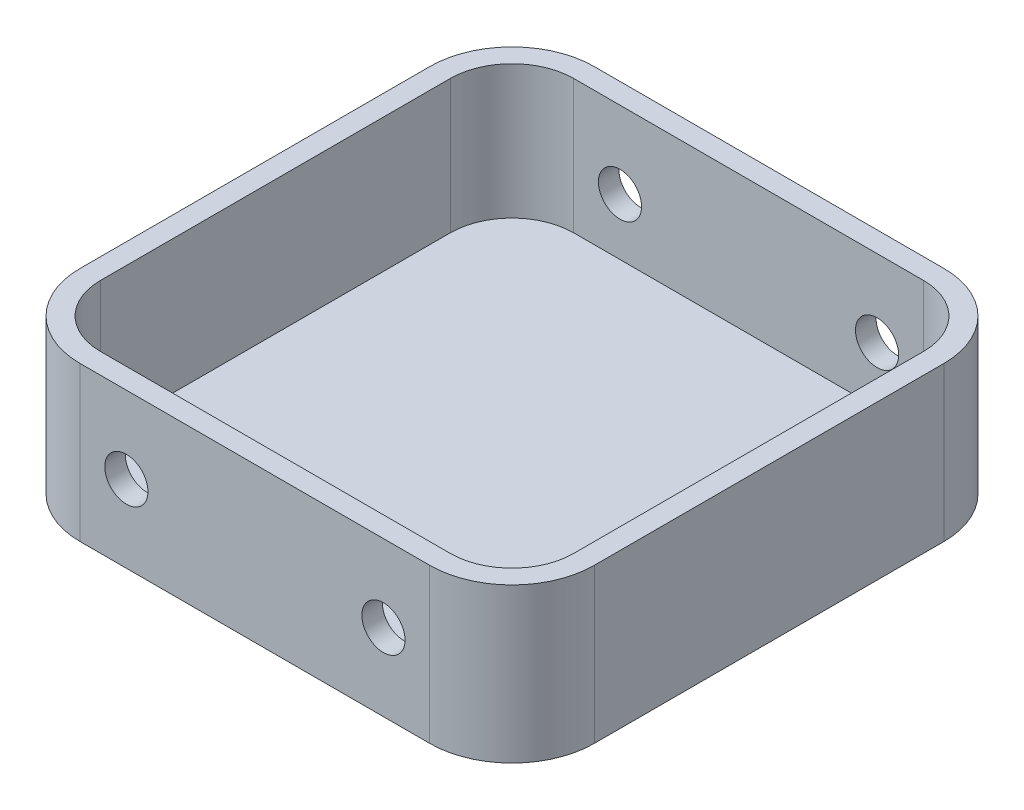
ISO-10303-21;
HEADER;
FILE_DESCRIPTION(('STEP AP214'),'2;1');
FILE_NAME('part.step','',(''),(''),'','','');
FILE_SCHEMA(('AUTOMOTIVE_DESIGN { 1 0 10303 214 1 1 1 1 }'));
ENDSEC;
DATA;
#1=APPLICATION_CONTEXT('core data for automotive mechanical design processes');
#2=APPLICATION_PROTOCOL_DEFINITION('international standard','automotive_design',2000,#1);
#3=PRODUCT_CONTEXT('',#1,'mechanical');
#4=PRODUCT('Part','Part','',(#3));
#5=PRODUCT_RELATED_PRODUCT_CATEGORY('part','',(#4));
#6=PRODUCT_DEFINITION_FORMATION('','',#4);
#7=PRODUCT_DEFINITION_CONTEXT('part definition',#1,'design');
#8=PRODUCT_DEFINITION('design','',#6,#7);
#9=PRODUCT_DEFINITION_SHAPE('','',#8);
#10=(LENGTH_UNIT() NAMED_UNIT(*) SI_UNIT(.MILLI.,.METRE.));
#11=(NAMED_UNIT(*) PLANE_ANGLE_UNIT() SI_UNIT($,.RADIAN.));
#12=(NAMED_UNIT(*) SI_UNIT($,.STERADIAN.) SOLID_ANGLE_UNIT());
#13=UNCERTAINTY_MEASURE_WITH_UNIT(LENGTH_MEASURE(1.E-05),#10,'distance_accuracy_value','');
#14=(GEOMETRIC_REPRESENTATION_CONTEXT(3) GLOBAL_UNCERTAINTY_ASSIGNED_CONTEXT((#13)) GLOBAL_UNIT_ASSIGNED_CONTEXT((#10,
#11,#12)) REPRESENTATION_CONTEXT('',''));
#15=CARTESIAN_POINT('',(0.,0.,0.));
#16=DIRECTION('',(0.,0.,1.));
#17=DIRECTION('',(1.,0.,0.));
#18=AXIS2_PLACEMENT_3D('',#15,#16,#17);
#19=CARTESIAN_POINT('',(25.,15.,-25.));
#20=DIRECTION('',(-1.,0.,0.));
#21=DIRECTION('',(0.,0.,1.));
#22=AXIS2_PLACEMENT_3D('',#19,#20,#21);
#23=PLANE('',#22);
#24=DIRECTION('',(0.,0.,-1.));
#25=VECTOR('',#24,1.);
#26=CARTESIAN_POINT('',(25.,15.,-25.));
#27=LINE('',#26,#25);
#28=CARTESIAN_POINT('',(25.,15.,17.));
#29=VERTEX_POINT('',#28);
#30=CARTESIAN_POINT('',(25.,15.,-17.));
#31=VERTEX_POINT('',#30);
#32=EDGE_CURVE('E215',#29,#31,#27,.T.);
#33=ORIENTED_EDGE('',*,*,#32,.F.);
#34=DIRECTION('',(0.,-1.,0.));
#35=VECTOR('',#34,1.);
#36=CARTESIAN_POINT('',(25.,15.,17.));
#37=LINE('',#36,#35);
#38=CARTESIAN_POINT('',(25.,0.,17.));
#39=VERTEX_POINT('',#38);
#40=EDGE_CURVE('E240',#29,#39,#37,.T.);
#41=ORIENTED_EDGE('',*,*,#40,.T.);
#42=DIRECTION('',(0.,0.,-1.));
#43=VECTOR('',#42,1.);
#44=CARTESIAN_POINT('',(25.,0.,-25.));
#45=LINE('',#44,#43);
#46=CARTESIAN_POINT('',(25.,0.,-17.));
#47=VERTEX_POINT('',#46);
#48=EDGE_CURVE('E228',#39,#47,#45,.T.);
#49=ORIENTED_EDGE('',*,*,#48,.T.);
#50=DIRECTION('',(0.,-1.,0.));
#51=VECTOR('',#50,1.);
#52=CARTESIAN_POINT('',(25.,15.,-17.));
#53=LINE('',#52,#51);
#54=EDGE_CURVE('E227',#47,#31,#53,.F.);
#55=ORIENTED_EDGE('',*,*,#54,.T.);
#56=EDGE_LOOP('',(#33,#41,#49,#55));
#57=FACE_BOUND('',#56,.T.);
#58=ADVANCED_FACE('F48',(#57),#23,.F.);
#59=CARTESIAN_POINT('',(-25.,15.,-25.));
#60=DIRECTION('',(0.,0.,1.));
#61=DIRECTION('',(1.,0.,0.));
#62=AXIS2_PLACEMENT_3D('',#59,#60,#61);
#63=PLANE('',#62);
#64=CARTESIAN_POINT('',(12.5,7.5,-25.));
#65=DIRECTION('',(0.,0.,-1.));
#66=DIRECTION('',(-1.,0.,0.));
#67=AXIS2_PLACEMENT_3D('',#64,#65,#66);
#68=CIRCLE('',#67,2.1);
#69=CARTESIAN_POINT('',(10.4,7.5,-25.));
#70=VERTEX_POINT('',#69);
#71=EDGE_CURVE('E560',#70,#70,#68,.T.);
#72=ORIENTED_EDGE('',*,*,#71,.F.);
#73=EDGE_LOOP('',(#72));
#74=FACE_BOUND('',#73,.T.);
#75=CARTESIAN_POINT('',(-12.5,7.5,-25.));
#76=DIRECTION('',(0.,0.,-1.));
#77=DIRECTION('',(-1.,0.,0.));
#78=AXIS2_PLACEMENT_3D('',#75,#76,#77);
#79=CIRCLE('',#78,2.1);
#80=CARTESIAN_POINT('',(-14.6,7.5,-25.));
#81=VERTEX_POINT('',#80);
#82=EDGE_CURVE('E278',#81,#81,#79,.T.);
#83=ORIENTED_EDGE('',*,*,#82,.F.);
#84=EDGE_LOOP('',(#83));
#85=FACE_BOUND('',#84,.T.);
#86=DIRECTION('',(-1.,0.,0.));
#87=VECTOR('',#86,1.);
#88=CARTESIAN_POINT('',(-25.,15.,-25.));
#89=LINE('',#88,#87);
#90=CARTESIAN_POINT('',(17.,15.,-25.));
#91=VERTEX_POINT('',#90);
#92=CARTESIAN_POINT('',(-17.,15.,-25.));
#93=VERTEX_POINT('',#92);
#94=EDGE_CURVE('E218',#91,#93,#89,.T.);
#95=ORIENTED_EDGE('',*,*,#94,.F.);
#96=DIRECTION('',(0.,-1.,0.));
#97=VECTOR('',#96,1.);
#98=CARTESIAN_POINT('',(17.,15.,-25.));
#99=LINE('',#98,#97);
#100=CARTESIAN_POINT('',(17.,0.,-25.));
#101=VERTEX_POINT('',#100);
#102=EDGE_CURVE('E13',#91,#101,#99,.T.);
#103=ORIENTED_EDGE('',*,*,#102,.T.);
#104=DIRECTION('',(-1.,0.,0.));
#105=VECTOR('',#104,1.);
#106=CARTESIAN_POINT('',(-25.,0.,-25.));
#107=LINE('',#106,#105);
#108=CARTESIAN_POINT('',(-17.,0.,-25.));
#109=VERTEX_POINT('',#108);
#110=EDGE_CURVE('E231',#101,#109,#107,.T.);
#111=ORIENTED_EDGE('',*,*,#110,.T.);
#112=DIRECTION('',(0.,-1.,0.));
#113=VECTOR('',#112,1.);
#114=CARTESIAN_POINT('',(-17.,15.,-25.));
#115=LINE('',#114,#113);
#116=EDGE_CURVE('E57',#109,#93,#115,.F.);
#117=ORIENTED_EDGE('',*,*,#116,.T.);
#118=EDGE_LOOP('',(#95,#103,#111,#117));
#119=FACE_BOUND('',#118,.T.);
#120=ADVANCED_FACE('F341',(#74,#85,#119),#63,.F.);
#121=CARTESIAN_POINT('',(-25.,15.,-25.));
#122=DIRECTION('',(1.,0.,0.));
#123=DIRECTION('',(0.,0.,-1.));
#124=AXIS2_PLACEMENT_3D('',#121,#122,#123);
#125=PLANE('',#124);
#126=DIRECTION('',(0.,0.,1.));
#127=VECTOR('',#126,1.);
#128=CARTESIAN_POINT('',(-25.,0.,-25.));
#129=LINE('',#128,#127);
#130=CARTESIAN_POINT('',(-25.,0.,-17.));
#131=VERTEX_POINT('',#130);
#132=CARTESIAN_POINT('',(-25.,0.,17.));
#133=VERTEX_POINT('',#132);
#134=EDGE_CURVE('E235',#131,#133,#129,.T.);
#135=ORIENTED_EDGE('',*,*,#134,.T.);
#136=DIRECTION('',(0.,-1.,0.));
#137=VECTOR('',#136,1.);
#138=CARTESIAN_POINT('',(-25.,15.,17.));
#139=LINE('',#138,#137);
#140=CARTESIAN_POINT('',(-25.,15.,17.));
#141=VERTEX_POINT('',#140);
#142=EDGE_CURVE('E73',#133,#141,#139,.F.);
#143=ORIENTED_EDGE('',*,*,#142,.T.);
#144=DIRECTION('',(0.,0.,1.));
#145=VECTOR('',#144,1.);
#146=CARTESIAN_POINT('',(-25.,15.,-25.));
#147=LINE('',#146,#145);
#148=CARTESIAN_POINT('',(-25.,15.,-17.));
#149=VERTEX_POINT('',#148);
#150=EDGE_CURVE('E222',#149,#141,#147,.T.);
#151=ORIENTED_EDGE('',*,*,#150,.F.);
#152=DIRECTION('',(0.,-1.,0.));
#153=VECTOR('',#152,1.);
#154=CARTESIAN_POINT('',(-25.,15.,-17.));
#155=LINE('',#154,#153);
#156=EDGE_CURVE('E264',#149,#131,#155,.T.);
#157=ORIENTED_EDGE('',*,*,#156,.T.);
#158=EDGE_LOOP('',(#135,#143,#151,#157));
#159=FACE_BOUND('',#158,.T.);
#160=ADVANCED_FACE('F347',(#159),#125,.F.);
#161=CARTESIAN_POINT('',(-25.,15.,25.));
#162=DIRECTION('',(0.,0.,-1.));
#163=DIRECTION('',(-1.,0.,0.));
#164=AXIS2_PLACEMENT_3D('',#161,#162,#163);
#165=PLANE('',#164);
#166=CARTESIAN_POINT('',(12.5,7.5,25.));
#167=DIRECTION('',(0.,0.,-1.));
#168=DIRECTION('',(-1.,0.,0.));
#169=AXIS2_PLACEMENT_3D('',#166,#167,#168);
#170=CIRCLE('',#169,2.1);
#171=CARTESIAN_POINT('',(10.4,7.5,25.));
#172=VERTEX_POINT('',#171);
#173=EDGE_CURVE('E561',#172,#172,#170,.T.);
#174=ORIENTED_EDGE('',*,*,#173,.T.);
#175=EDGE_LOOP('',(#174));
#176=FACE_BOUND('',#175,.T.);
#177=CARTESIAN_POINT('',(-12.5,7.5,25.));
#178=DIRECTION('',(0.,0.,-1.));
#179=DIRECTION('',(-1.,0.,0.));
#180=AXIS2_PLACEMENT_3D('',#177,#178,#179);
#181=CIRCLE('',#180,2.1);
#182=CARTESIAN_POINT('',(-14.6,7.5,25.));
#183=VERTEX_POINT('',#182);
#184=EDGE_CURVE('E271',#183,#183,#181,.T.);
#185=ORIENTED_EDGE('',*,*,#184,.T.);
#186=EDGE_LOOP('',(#185));
#187=FACE_BOUND('',#186,.T.);
#188=DIRECTION('',(1.,0.,0.));
#189=VECTOR('',#188,1.);
#190=CARTESIAN_POINT('',(-25.,0.,25.));
#191=LINE('',#190,#189);
#192=CARTESIAN_POINT('',(-17.,0.,25.));
#193=VERTEX_POINT('',#192);
#194=CARTESIAN_POINT('',(17.,0.,25.));
#195=VERTEX_POINT('',#194);
#196=EDGE_CURVE('E219',#193,#195,#191,.T.);
#197=ORIENTED_EDGE('',*,*,#196,.T.);
#198=DIRECTION('',(0.,-1.,0.));
#199=VECTOR('',#198,1.);
#200=CARTESIAN_POINT('',(17.,15.,25.));
#201=LINE('',#200,#199);
#202=CARTESIAN_POINT('',(17.,15.,25.));
#203=VERTEX_POINT('',#202);
#204=EDGE_CURVE('E254',#195,#203,#201,.F.);
#205=ORIENTED_EDGE('',*,*,#204,.T.);
#206=DIRECTION('',(1.,0.,0.));
#207=VECTOR('',#206,1.);
#208=CARTESIAN_POINT('',(-25.,15.,25.));
#209=LINE('',#208,#207);
#210=CARTESIAN_POINT('',(-17.,15.,25.));
#211=VERTEX_POINT('',#210);
#212=EDGE_CURVE('E224',#211,#203,#209,.T.);
#213=ORIENTED_EDGE('',*,*,#212,.F.);
#214=DIRECTION('',(0.,-1.,0.));
#215=VECTOR('',#214,1.);
#216=CARTESIAN_POINT('',(-17.,15.,25.));
#217=LINE('',#216,#215);
#218=EDGE_CURVE('E251',#211,#193,#217,.T.);
#219=ORIENTED_EDGE('',*,*,#218,.T.);
#220=EDGE_LOOP('',(#197,#205,#213,#219));
#221=FACE_BOUND('',#220,.T.);
#222=ADVANCED_FACE('F385',(#176,#187,#221),#165,.F.);
#223=CARTESIAN_POINT('',(0.,15.,0.));
#224=DIRECTION('',(0.,1.,0.));
#225=DIRECTION('',(0.,0.,1.));
#226=AXIS2_PLACEMENT_3D('',#223,#224,#225);
#227=PLANE('',#226);
#228=DIRECTION('',(1.,0.,0.));
#229=VECTOR('',#228,1.);
#230=CARTESIAN_POINT('',(-25.,15.,23.));
#231=LINE('',#230,#229);
#232=CARTESIAN_POINT('',(-17.,15.,23.));
#233=VERTEX_POINT('',#232);
#234=CARTESIAN_POINT('',(17.,15.,23.));
#235=VERTEX_POINT('',#234);
#236=EDGE_CURVE('E192',#233,#235,#231,.T.);
#237=ORIENTED_EDGE('',*,*,#236,.F.);
#238=CARTESIAN_POINT('',(-17.,15.,17.));
#239=DIRECTION('',(0.,1.,0.));
#240=DIRECTION('',(0.,0.,1.));
#241=AXIS2_PLACEMENT_3D('',#238,#239,#240);
#242=CIRCLE('',#241,6.);
#243=CARTESIAN_POINT('',(-23.,15.,17.));
#244=VERTEX_POINT('',#243);
#245=EDGE_CURVE('E205',#244,#233,#242,.T.);
#246=ORIENTED_EDGE('',*,*,#245,.F.);
#247=DIRECTION('',(0.,0.,1.));
#248=VECTOR('',#247,1.);
#249=CARTESIAN_POINT('',(-23.,15.,-25.));
#250=LINE('',#249,#248);
#251=CARTESIAN_POINT('',(-23.,15.,-17.));
#252=VERTEX_POINT('',#251);
#253=EDGE_CURVE('E65',#252,#244,#250,.T.);
#254=ORIENTED_EDGE('',*,*,#253,.F.);
#255=CARTESIAN_POINT('',(-17.,15.,-17.));
#256=DIRECTION('',(0.,1.,0.));
#257=DIRECTION('',(0.,0.,1.));
#258=AXIS2_PLACEMENT_3D('',#255,#256,#257);
#259=CIRCLE('',#258,6.);
#260=CARTESIAN_POINT('',(-17.,15.,-23.));
#261=VERTEX_POINT('',#260);
#262=EDGE_CURVE('E194',#261,#252,#259,.T.);
#263=ORIENTED_EDGE('',*,*,#262,.F.);
#264=DIRECTION('',(-1.,0.,0.));
#265=VECTOR('',#264,1.);
#266=CARTESIAN_POINT('',(-25.,15.,-23.));
#267=LINE('',#266,#265);
#268=CARTESIAN_POINT('',(17.,15.,-23.));
#269=VERTEX_POINT('',#268);
#270=EDGE_CURVE('E203',#269,#261,#267,.T.);
#271=ORIENTED_EDGE('',*,*,#270,.F.);
#272=CARTESIAN_POINT('',(17.,15.,-17.));
#273=DIRECTION('',(0.,1.,0.));
#274=DIRECTION('',(0.,0.,1.));
#275=AXIS2_PLACEMENT_3D('',#272,#273,#274);
#276=CIRCLE('',#275,6.);
#277=CARTESIAN_POINT('',(23.,15.,-17.));
#278=VERTEX_POINT('',#277);
#279=EDGE_CURVE('E196',#278,#269,#276,.T.);
#280=ORIENTED_EDGE('',*,*,#279,.F.);
#281=DIRECTION('',(0.,0.,-1.));
#282=VECTOR('',#281,1.);
#283=CARTESIAN_POINT('',(23.,15.,-25.));
#284=LINE('',#283,#282);
#285=CARTESIAN_POINT('',(23.,15.,17.));
#286=VERTEX_POINT('',#285);
#287=EDGE_CURVE('E187',#286,#278,#284,.T.);
#288=ORIENTED_EDGE('',*,*,#287,.F.);
#289=CARTESIAN_POINT('',(17.,15.,17.));
#290=DIRECTION('',(0.,1.,0.));
#291=DIRECTION('',(0.,0.,1.));
#292=AXIS2_PLACEMENT_3D('',#289,#290,#291);
#293=CIRCLE('',#292,6.);
#294=EDGE_CURVE('E210',#235,#286,#293,.T.);
#295=ORIENTED_EDGE('',*,*,#294,.F.);
#296=EDGE_LOOP('',(#237,#246,#254,#263,#271,#280,#288,#295));
#297=FACE_BOUND('',#296,.T.);
#298=ORIENTED_EDGE('',*,*,#212,.T.);
#299=CARTESIAN_POINT('',(17.,15.,17.));
#300=DIRECTION('',(0.,1.,0.));
#301=DIRECTION('',(0.,0.,1.));
#302=AXIS2_PLACEMENT_3D('',#299,#300,#301);
#303=CIRCLE('',#302,8.);
#304=EDGE_CURVE('E262',#203,#29,#303,.T.);
#305=ORIENTED_EDGE('',*,*,#304,.T.);
#306=ORIENTED_EDGE('',*,*,#32,.T.);
#307=CARTESIAN_POINT('',(17.,15.,-17.));
#308=DIRECTION('',(0.,1.,0.));
#309=DIRECTION('',(0.,0.,1.));
#310=AXIS2_PLACEMENT_3D('',#307,#308,#309);
#311=CIRCLE('',#310,8.);
#312=EDGE_CURVE('E258',#31,#91,#311,.T.);
#313=ORIENTED_EDGE('',*,*,#312,.T.);
#314=ORIENTED_EDGE('',*,*,#94,.T.);
#315=CARTESIAN_POINT('',(-17.,15.,-17.));
#316=DIRECTION('',(0.,1.,0.));
#317=DIRECTION('',(0.,0.,1.));
#318=AXIS2_PLACEMENT_3D('',#315,#316,#317);
#319=CIRCLE('',#318,8.);
#320=EDGE_CURVE('E256',#93,#149,#319,.T.);
#321=ORIENTED_EDGE('',*,*,#320,.T.);
#322=ORIENTED_EDGE('',*,*,#150,.T.);
#323=CARTESIAN_POINT('',(-17.,15.,17.));
#324=DIRECTION('',(0.,1.,0.));
#325=DIRECTION('',(0.,0.,1.));
#326=AXIS2_PLACEMENT_3D('',#323,#324,#325);
#327=CIRCLE('',#326,8.);
#328=EDGE_CURVE('E260',#141,#211,#327,.T.);
#329=ORIENTED_EDGE('',*,*,#328,.T.);
#330=EDGE_LOOP('',(#298,#305,#306,#313,#314,#321,#322,#329));
#331=FACE_BOUND('',#330,.T.);
#332=ADVANCED_FACE('F311',(#297,#331),#227,.T.);
#333=CARTESIAN_POINT('',(0.,0.,0.));
#334=DIRECTION('',(0.,1.,0.));
#335=DIRECTION('',(0.,0.,1.));
#336=AXIS2_PLACEMENT_3D('',#333,#334,#335);
#337=PLANE('',#336);
#338=ORIENTED_EDGE('',*,*,#48,.F.);
#339=CARTESIAN_POINT('',(17.,0.,17.));
#340=DIRECTION('',(0.,1.,0.));
#341=DIRECTION('',(0.,0.,1.));
#342=AXIS2_PLACEMENT_3D('',#339,#340,#341);
#343=CIRCLE('',#342,8.);
#344=EDGE_CURVE('E249',#39,#195,#343,.F.);
#345=ORIENTED_EDGE('',*,*,#344,.T.);
#346=ORIENTED_EDGE('',*,*,#196,.F.);
#347=CARTESIAN_POINT('',(-17.,0.,17.));
#348=DIRECTION('',(0.,1.,0.));
#349=DIRECTION('',(0.,0.,1.));
#350=AXIS2_PLACEMENT_3D('',#347,#348,#349);
#351=CIRCLE('',#350,8.);
#352=EDGE_CURVE('E247',#193,#133,#351,.F.);
#353=ORIENTED_EDGE('',*,*,#352,.T.);
#354=ORIENTED_EDGE('',*,*,#134,.F.);
#355=CARTESIAN_POINT('',(-17.,0.,-17.));
#356=DIRECTION('',(0.,1.,0.));
#357=DIRECTION('',(0.,0.,1.));
#358=AXIS2_PLACEMENT_3D('',#355,#356,#357);
#359=CIRCLE('',#358,8.);
#360=EDGE_CURVE('E243',#131,#109,#359,.F.);
#361=ORIENTED_EDGE('',*,*,#360,.T.);
#362=ORIENTED_EDGE('',*,*,#110,.F.);
#363=CARTESIAN_POINT('',(17.,0.,-17.));
#364=DIRECTION('',(0.,1.,0.));
#365=DIRECTION('',(0.,0.,1.));
#366=AXIS2_PLACEMENT_3D('',#363,#364,#365);
#367=CIRCLE('',#366,8.);
#368=EDGE_CURVE('E245',#101,#47,#367,.F.);
#369=ORIENTED_EDGE('',*,*,#368,.T.);
#370=EDGE_LOOP('',(#338,#345,#346,#353,#354,#361,#362,#369));
#371=FACE_BOUND('',#370,.T.);
#372=ADVANCED_FACE('F357',(#371),#337,.F.);
#373=CARTESIAN_POINT('',(17.,15.,17.));
#374=DIRECTION('',(0.,-1.,0.));
#375=DIRECTION('',(0.,0.,-1.));
#376=AXIS2_PLACEMENT_3D('',#373,#374,#375);
#377=CYLINDRICAL_SURFACE('',#376,8.);
#378=ORIENTED_EDGE('',*,*,#304,.F.);
#379=ORIENTED_EDGE('',*,*,#204,.F.);
#380=ORIENTED_EDGE('',*,*,#344,.F.);
#381=ORIENTED_EDGE('',*,*,#40,.F.);
#382=EDGE_LOOP('',(#378,#379,#380,#381));
#383=FACE_BOUND('',#382,.T.);
#384=ADVANCED_FACE('F353',(#383),#377,.T.);
#385=CARTESIAN_POINT('',(-17.,15.,17.));
#386=DIRECTION('',(0.,-1.,0.));
#387=DIRECTION('',(0.,0.,-1.));
#388=AXIS2_PLACEMENT_3D('',#385,#386,#387);
#389=CYLINDRICAL_SURFACE('',#388,8.);
#390=ORIENTED_EDGE('',*,*,#328,.F.);
#391=ORIENTED_EDGE('',*,*,#142,.F.);
#392=ORIENTED_EDGE('',*,*,#352,.F.);
#393=ORIENTED_EDGE('',*,*,#218,.F.);
#394=EDGE_LOOP('',(#390,#391,#392,#393));
#395=FACE_BOUND('',#394,.T.);
#396=ADVANCED_FACE('F356',(#395),#389,.T.);
#397=CARTESIAN_POINT('',(17.,15.,-17.));
#398=DIRECTION('',(0.,-1.,0.));
#399=DIRECTION('',(0.,0.,-1.));
#400=AXIS2_PLACEMENT_3D('',#397,#398,#399);
#401=CYLINDRICAL_SURFACE('',#400,8.);
#402=ORIENTED_EDGE('',*,*,#312,.F.);
#403=ORIENTED_EDGE('',*,*,#54,.F.);
#404=ORIENTED_EDGE('',*,*,#368,.F.);
#405=ORIENTED_EDGE('',*,*,#102,.F.);
#406=EDGE_LOOP('',(#402,#403,#404,#405));
#407=FACE_BOUND('',#406,.T.);
#408=ADVANCED_FACE('F360',(#407),#401,.T.);
#409=CARTESIAN_POINT('',(-17.,15.,-17.));
#410=DIRECTION('',(0.,-1.,0.));
#411=DIRECTION('',(0.,0.,-1.));
#412=AXIS2_PLACEMENT_3D('',#409,#410,#411);
#413=CYLINDRICAL_SURFACE('',#412,8.);
#414=ORIENTED_EDGE('',*,*,#320,.F.);
#415=ORIENTED_EDGE('',*,*,#116,.F.);
#416=ORIENTED_EDGE('',*,*,#360,.F.);
#417=ORIENTED_EDGE('',*,*,#156,.F.);
#418=EDGE_LOOP('',(#414,#415,#416,#417));
#419=FACE_BOUND('',#418,.T.);
#420=ADVANCED_FACE('F50',(#419),#413,.T.);
#421=CARTESIAN_POINT('',(23.,15.,-25.));
#422=DIRECTION('',(-1.,0.,0.));
#423=DIRECTION('',(0.,0.,1.));
#424=AXIS2_PLACEMENT_3D('',#421,#422,#423);
#425=PLANE('',#424);
#426=ORIENTED_EDGE('',*,*,#287,.T.);
#427=DIRECTION('',(0.,1.,0.));
#428=VECTOR('',#427,1.);
#429=CARTESIAN_POINT('',(23.,15.,-17.));
#430=LINE('',#429,#428);
#431=CARTESIAN_POINT('',(23.,2.,-17.));
#432=VERTEX_POINT('',#431);
#433=EDGE_CURVE('E212',#432,#278,#430,.T.);
#434=ORIENTED_EDGE('',*,*,#433,.F.);
#435=DIRECTION('',(0.,0.,-1.));
#436=VECTOR('',#435,1.);
#437=CARTESIAN_POINT('',(23.,2.,-25.));
#438=LINE('',#437,#436);
#439=CARTESIAN_POINT('',(23.,2.,17.));
#440=VERTEX_POINT('',#439);
#441=EDGE_CURVE('E275',#440,#432,#438,.T.);
#442=ORIENTED_EDGE('',*,*,#441,.F.);
#443=DIRECTION('',(0.,1.,0.));
#444=VECTOR('',#443,1.);
#445=CARTESIAN_POINT('',(23.,15.,17.));
#446=LINE('',#445,#444);
#447=EDGE_CURVE('E173',#286,#440,#446,.F.);
#448=ORIENTED_EDGE('',*,*,#447,.F.);
#449=EDGE_LOOP('',(#426,#434,#442,#448));
#450=FACE_BOUND('',#449,.T.);
#451=ADVANCED_FACE('F317',(#450),#425,.T.);
#452=CARTESIAN_POINT('',(-25.,15.,-23.));
#453=DIRECTION('',(0.,0.,1.));
#454=DIRECTION('',(1.,0.,0.));
#455=AXIS2_PLACEMENT_3D('',#452,#453,#454);
#456=PLANE('',#455);
#457=CARTESIAN_POINT('',(12.5,7.5,-23.));
#458=DIRECTION('',(0.,0.,1.));
#459=DIRECTION('',(1.,0.,0.));
#460=AXIS2_PLACEMENT_3D('',#457,#458,#459);
#461=CIRCLE('',#460,2.1);
#462=CARTESIAN_POINT('',(14.6,7.5,-23.));
#463=VERTEX_POINT('',#462);
#464=EDGE_CURVE('E283',#463,#463,#461,.T.);
#465=ORIENTED_EDGE('',*,*,#464,.F.);
#466=EDGE_LOOP('',(#465));
#467=FACE_BOUND('',#466,.T.);
#468=CARTESIAN_POINT('',(-12.5,7.5,-23.));
#469=DIRECTION('',(0.,0.,1.));
#470=DIRECTION('',(1.,0.,0.));
#471=AXIS2_PLACEMENT_3D('',#468,#469,#470);
#472=CIRCLE('',#471,2.1);
#473=CARTESIAN_POINT('',(-10.4,7.5,-23.));
#474=VERTEX_POINT('',#473);
#475=EDGE_CURVE('E270',#474,#474,#472,.T.);
#476=ORIENTED_EDGE('',*,*,#475,.F.);
#477=EDGE_LOOP('',(#476));
#478=FACE_BOUND('',#477,.T.);
#479=ORIENTED_EDGE('',*,*,#270,.T.);
#480=DIRECTION('',(0.,1.,0.));
#481=VECTOR('',#480,1.);
#482=CARTESIAN_POINT('',(-17.,15.,-23.));
#483=LINE('',#482,#481);
#484=CARTESIAN_POINT('',(-17.,2.,-23.));
#485=VERTEX_POINT('',#484);
#486=EDGE_CURVE('E302',#485,#261,#483,.T.);
#487=ORIENTED_EDGE('',*,*,#486,.F.);
#488=DIRECTION('',(-1.,0.,0.));
#489=VECTOR('',#488,1.);
#490=CARTESIAN_POINT('',(-25.,2.,-23.));
#491=LINE('',#490,#489);
#492=CARTESIAN_POINT('',(17.,2.,-23.));
#493=VERTEX_POINT('',#492);
#494=EDGE_CURVE('E291',#493,#485,#491,.T.);
#495=ORIENTED_EDGE('',*,*,#494,.F.);
#496=DIRECTION('',(0.,1.,0.));
#497=VECTOR('',#496,1.);
#498=CARTESIAN_POINT('',(17.,15.,-23.));
#499=LINE('',#498,#497);
#500=EDGE_CURVE('E232',#269,#493,#499,.F.);
#501=ORIENTED_EDGE('',*,*,#500,.F.);
#502=EDGE_LOOP('',(#479,#487,#495,#501));
#503=FACE_BOUND('',#502,.T.);
#504=ADVANCED_FACE('F326',(#467,#478,#503),#456,.T.);
#505=CARTESIAN_POINT('',(-23.,15.,-25.));
#506=DIRECTION('',(1.,0.,0.));
#507=DIRECTION('',(0.,0.,-1.));
#508=AXIS2_PLACEMENT_3D('',#505,#506,#507);
#509=PLANE('',#508);
#510=DIRECTION('',(0.,0.,1.));
#511=VECTOR('',#510,1.);
#512=CARTESIAN_POINT('',(-23.,2.,-25.));
#513=LINE('',#512,#511);
#514=CARTESIAN_POINT('',(-23.,2.,-17.));
#515=VERTEX_POINT('',#514);
#516=CARTESIAN_POINT('',(-23.,2.,17.));
#517=VERTEX_POINT('',#516);
#518=EDGE_CURVE('E188',#515,#517,#513,.T.);
#519=ORIENTED_EDGE('',*,*,#518,.F.);
#520=DIRECTION('',(0.,1.,0.));
#521=VECTOR('',#520,1.);
#522=CARTESIAN_POINT('',(-23.,15.,-17.));
#523=LINE('',#522,#521);
#524=EDGE_CURVE('E214',#252,#515,#523,.F.);
#525=ORIENTED_EDGE('',*,*,#524,.F.);
#526=ORIENTED_EDGE('',*,*,#253,.T.);
#527=DIRECTION('',(0.,1.,0.));
#528=VECTOR('',#527,1.);
#529=CARTESIAN_POINT('',(-23.,15.,17.));
#530=LINE('',#529,#528);
#531=EDGE_CURVE('E304',#517,#244,#530,.T.);
#532=ORIENTED_EDGE('',*,*,#531,.F.);
#533=EDGE_LOOP('',(#519,#525,#526,#532));
#534=FACE_BOUND('',#533,.T.);
#535=ADVANCED_FACE('F329',(#534),#509,.T.);
#536=CARTESIAN_POINT('',(-25.,15.,23.));
#537=DIRECTION('',(0.,0.,-1.));
#538=DIRECTION('',(-1.,0.,0.));
#539=AXIS2_PLACEMENT_3D('',#536,#537,#538);
#540=PLANE('',#539);
#541=CARTESIAN_POINT('',(12.5,7.5,23.));
#542=DIRECTION('',(0.,0.,-1.));
#543=DIRECTION('',(-1.,0.,0.));
#544=AXIS2_PLACEMENT_3D('',#541,#542,#543);
#545=CIRCLE('',#544,2.1);
#546=CARTESIAN_POINT('',(10.4,7.5,23.));
#547=VERTEX_POINT('',#546);
#548=EDGE_CURVE('E52',#547,#547,#545,.T.);
#549=ORIENTED_EDGE('',*,*,#548,.F.);
#550=EDGE_LOOP('',(#549));
#551=FACE_BOUND('',#550,.T.);
#552=CARTESIAN_POINT('',(-12.5,7.5,23.));
#553=DIRECTION('',(0.,0.,-1.));
#554=DIRECTION('',(-1.,0.,0.));
#555=AXIS2_PLACEMENT_3D('',#552,#553,#554);
#556=CIRCLE('',#555,2.1);
#557=CARTESIAN_POINT('',(-14.6,7.5,23.));
#558=VERTEX_POINT('',#557);
#559=EDGE_CURVE('E268',#558,#558,#556,.T.);
#560=ORIENTED_EDGE('',*,*,#559,.F.);
#561=EDGE_LOOP('',(#560));
#562=FACE_BOUND('',#561,.T.);
#563=DIRECTION('',(1.,0.,0.));
#564=VECTOR('',#563,1.);
#565=CARTESIAN_POINT('',(-25.,2.,23.));
#566=LINE('',#565,#564);
#567=CARTESIAN_POINT('',(-17.,2.,23.));
#568=VERTEX_POINT('',#567);
#569=CARTESIAN_POINT('',(17.,2.,23.));
#570=VERTEX_POINT('',#569);
#571=EDGE_CURVE('E181',#568,#570,#566,.T.);
#572=ORIENTED_EDGE('',*,*,#571,.F.);
#573=DIRECTION('',(0.,1.,0.));
#574=VECTOR('',#573,1.);
#575=CARTESIAN_POINT('',(-17.,15.,23.));
#576=LINE('',#575,#574);
#577=EDGE_CURVE('E177',#233,#568,#576,.F.);
#578=ORIENTED_EDGE('',*,*,#577,.F.);
#579=ORIENTED_EDGE('',*,*,#236,.T.);
#580=DIRECTION('',(0.,1.,0.));
#581=VECTOR('',#580,1.);
#582=CARTESIAN_POINT('',(17.,15.,23.));
#583=LINE('',#582,#581);
#584=EDGE_CURVE('E170',#570,#235,#583,.T.);
#585=ORIENTED_EDGE('',*,*,#584,.F.);
#586=EDGE_LOOP('',(#572,#578,#579,#585));
#587=FACE_BOUND('',#586,.T.);
#588=ADVANCED_FACE('F190',(#551,#562,#587),#540,.T.);
#589=CARTESIAN_POINT('',(0.,2.,0.));
#590=DIRECTION('',(0.,1.,0.));
#591=DIRECTION('',(0.,0.,1.));
#592=AXIS2_PLACEMENT_3D('',#589,#590,#591);
#593=PLANE('',#592);
#594=ORIENTED_EDGE('',*,*,#441,.T.);
#595=CARTESIAN_POINT('',(17.,2.,-17.));
#596=DIRECTION('',(0.,1.,0.));
#597=DIRECTION('',(0.,0.,1.));
#598=AXIS2_PLACEMENT_3D('',#595,#596,#597);
#599=CIRCLE('',#598,6.);
#600=EDGE_CURVE('E294',#493,#432,#599,.F.);
#601=ORIENTED_EDGE('',*,*,#600,.F.);
#602=ORIENTED_EDGE('',*,*,#494,.T.);
#603=CARTESIAN_POINT('',(-17.,2.,-17.));
#604=DIRECTION('',(0.,1.,0.));
#605=DIRECTION('',(0.,0.,1.));
#606=AXIS2_PLACEMENT_3D('',#603,#604,#605);
#607=CIRCLE('',#606,6.);
#608=EDGE_CURVE('E289',#515,#485,#607,.F.);
#609=ORIENTED_EDGE('',*,*,#608,.F.);
#610=ORIENTED_EDGE('',*,*,#518,.T.);
#611=CARTESIAN_POINT('',(-17.,2.,17.));
#612=DIRECTION('',(0.,1.,0.));
#613=DIRECTION('',(0.,0.,1.));
#614=AXIS2_PLACEMENT_3D('',#611,#612,#613);
#615=CIRCLE('',#614,6.);
#616=EDGE_CURVE('E178',#568,#517,#615,.F.);
#617=ORIENTED_EDGE('',*,*,#616,.F.);
#618=ORIENTED_EDGE('',*,*,#571,.T.);
#619=CARTESIAN_POINT('',(17.,2.,17.));
#620=DIRECTION('',(0.,1.,0.));
#621=DIRECTION('',(0.,0.,1.));
#622=AXIS2_PLACEMENT_3D('',#619,#620,#621);
#623=CIRCLE('',#622,6.);
#624=EDGE_CURVE('E166',#440,#570,#623,.F.);
#625=ORIENTED_EDGE('',*,*,#624,.F.);
#626=EDGE_LOOP('',(#594,#601,#602,#609,#610,#617,#618,#625));
#627=FACE_BOUND('',#626,.T.);
#628=ADVANCED_FACE('F182',(#627),#593,.T.);
#629=CARTESIAN_POINT('',(17.,15.,17.));
#630=DIRECTION('',(0.,-1.,0.));
#631=DIRECTION('',(0.,0.,-1.));
#632=AXIS2_PLACEMENT_3D('',#629,#630,#631);
#633=CYLINDRICAL_SURFACE('',#632,6.);
#634=ORIENTED_EDGE('',*,*,#294,.T.);
#635=ORIENTED_EDGE('',*,*,#447,.T.);
#636=ORIENTED_EDGE('',*,*,#624,.T.);
#637=ORIENTED_EDGE('',*,*,#584,.T.);
#638=EDGE_LOOP('',(#634,#635,#636,#637));
#639=FACE_BOUND('',#638,.T.);
#640=ADVANCED_FACE('F168',(#639),#633,.F.);
#641=CARTESIAN_POINT('',(-17.,15.,17.));
#642=DIRECTION('',(0.,-1.,0.));
#643=DIRECTION('',(0.,0.,-1.));
#644=AXIS2_PLACEMENT_3D('',#641,#642,#643);
#645=CYLINDRICAL_SURFACE('',#644,6.);
#646=ORIENTED_EDGE('',*,*,#245,.T.);
#647=ORIENTED_EDGE('',*,*,#577,.T.);
#648=ORIENTED_EDGE('',*,*,#616,.T.);
#649=ORIENTED_EDGE('',*,*,#531,.T.);
#650=EDGE_LOOP('',(#646,#647,#648,#649));
#651=FACE_BOUND('',#650,.T.);
#652=ADVANCED_FACE('F308',(#651),#645,.F.);
#653=CARTESIAN_POINT('',(17.,15.,-17.));
#654=DIRECTION('',(0.,-1.,0.));
#655=DIRECTION('',(0.,0.,-1.));
#656=AXIS2_PLACEMENT_3D('',#653,#654,#655);
#657=CYLINDRICAL_SURFACE('',#656,6.);
#658=ORIENTED_EDGE('',*,*,#279,.T.);
#659=ORIENTED_EDGE('',*,*,#500,.T.);
#660=ORIENTED_EDGE('',*,*,#600,.T.);
#661=ORIENTED_EDGE('',*,*,#433,.T.);
#662=EDGE_LOOP('',(#658,#659,#660,#661));
#663=FACE_BOUND('',#662,.T.);
#664=ADVANCED_FACE('F323',(#663),#657,.F.);
#665=CARTESIAN_POINT('',(-17.,15.,-17.));
#666=DIRECTION('',(0.,-1.,0.));
#667=DIRECTION('',(0.,0.,-1.));
#668=AXIS2_PLACEMENT_3D('',#665,#666,#667);
#669=CYLINDRICAL_SURFACE('',#668,6.);
#670=ORIENTED_EDGE('',*,*,#262,.T.);
#671=ORIENTED_EDGE('',*,*,#524,.T.);
#672=ORIENTED_EDGE('',*,*,#608,.T.);
#673=ORIENTED_EDGE('',*,*,#486,.T.);
#674=EDGE_LOOP('',(#670,#671,#672,#673));
#675=FACE_BOUND('',#674,.T.);
#676=ADVANCED_FACE('F328',(#675),#669,.F.);
#677=CARTESIAN_POINT('',(-12.5,7.5,25.));
#678=DIRECTION('',(0.,0.,-1.));
#679=DIRECTION('',(-1.,0.,0.));
#680=AXIS2_PLACEMENT_3D('',#677,#678,#679);
#681=CYLINDRICAL_SURFACE('',#680,2.1);
#682=ORIENTED_EDGE('',*,*,#559,.T.);
#683=EDGE_LOOP('',(#682));
#684=FACE_BOUND('',#683,.T.);
#685=ORIENTED_EDGE('',*,*,#184,.F.);
#686=EDGE_LOOP('',(#685));
#687=FACE_BOUND('',#686,.T.);
#688=ADVANCED_FACE('F403',(#684,#687),#681,.F.);
#689=ORIENTED_EDGE('',*,*,#475,.T.);
#690=EDGE_LOOP('',(#689));
#691=FACE_BOUND('',#690,.T.);
#692=ORIENTED_EDGE('',*,*,#82,.T.);
#693=EDGE_LOOP('',(#692));
#694=FACE_BOUND('',#693,.T.);
#695=ADVANCED_FACE('F438',(#691,#694),#681,.F.);
#696=CARTESIAN_POINT('',(12.5,7.5,25.));
#697=DIRECTION('',(0.,0.,-1.));
#698=DIRECTION('',(-1.,0.,0.));
#699=AXIS2_PLACEMENT_3D('',#696,#697,#698);
#700=CYLINDRICAL_SURFACE('',#699,2.1);
#701=ORIENTED_EDGE('',*,*,#548,.T.);
#702=EDGE_LOOP('',(#701));
#703=FACE_BOUND('',#702,.T.);
#704=ORIENTED_EDGE('',*,*,#173,.F.);
#705=EDGE_LOOP('',(#704));
#706=FACE_BOUND('',#705,.T.);
#707=ADVANCED_FACE('F445',(#703,#706),#700,.F.);
#708=ORIENTED_EDGE('',*,*,#464,.T.);
#709=EDGE_LOOP('',(#708));
#710=FACE_BOUND('',#709,.T.);
#711=ORIENTED_EDGE('',*,*,#71,.T.);
#712=EDGE_LOOP('',(#711));
#713=FACE_BOUND('',#712,.T.);
#714=ADVANCED_FACE('F452',(#710,#713),#700,.F.);
#715=CLOSED_SHELL('',(#58,#120,#160,#222,#332,#372,#384,#396,#408,#420,#451,#504,#535,#588,#628,
#640,#652,#664,#676,#688,#695,#707,#714));
#716=MANIFOLD_SOLID_BREP('B2',#715);
#717=ADVANCED_BREP_SHAPE_REPRESENTATION('',(#18,#716),#14);
#718=SHAPE_DEFINITION_REPRESENTATION(#9,#717);
ENDSEC;
END-ISO-10303-21;
